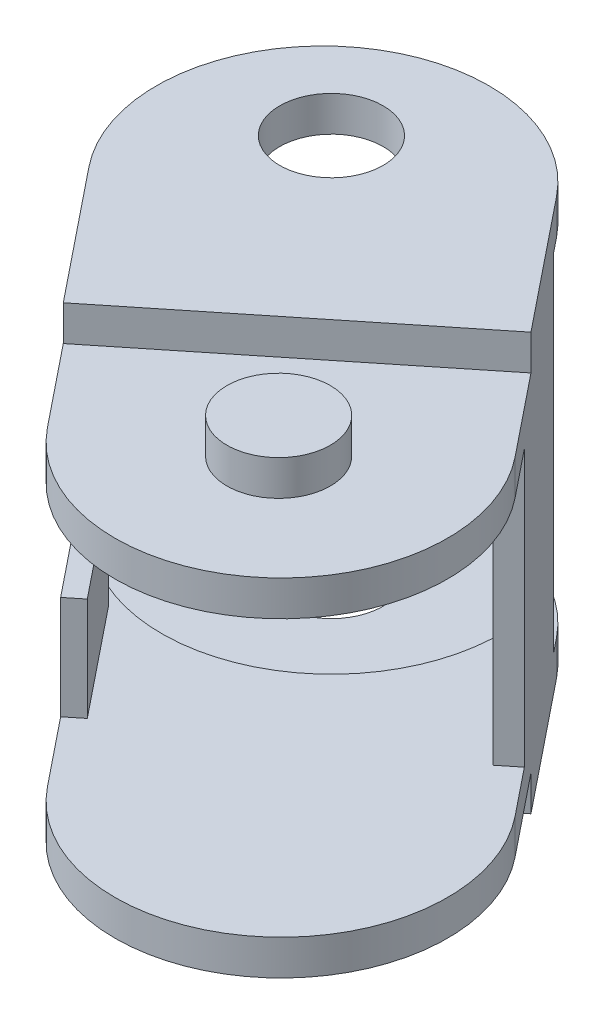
ISO-10303-21;
HEADER;
FILE_DESCRIPTION(('STEP AP214'),'2;1');
FILE_NAME('part.step','',(''),(''),'','','');
FILE_SCHEMA(('AUTOMOTIVE_DESIGN { 1 0 10303 214 1 1 1 1 }'));
ENDSEC;
DATA;
#1=APPLICATION_CONTEXT('core data for automotive mechanical design processes');
#2=APPLICATION_PROTOCOL_DEFINITION('international standard','automotive_design',2000,#1);
#3=PRODUCT_CONTEXT('',#1,'mechanical');
#4=PRODUCT('Part','Part','',(#3));
#5=PRODUCT_RELATED_PRODUCT_CATEGORY('part','',(#4));
#6=PRODUCT_DEFINITION_FORMATION('','',#4);
#7=PRODUCT_DEFINITION_CONTEXT('part definition',#1,'design');
#8=PRODUCT_DEFINITION('design','',#6,#7);
#9=PRODUCT_DEFINITION_SHAPE('','',#8);
#10=(LENGTH_UNIT() NAMED_UNIT(*) SI_UNIT(.MILLI.,.METRE.));
#11=(NAMED_UNIT(*) PLANE_ANGLE_UNIT() SI_UNIT($,.RADIAN.));
#12=(NAMED_UNIT(*) SI_UNIT($,.STERADIAN.) SOLID_ANGLE_UNIT());
#13=UNCERTAINTY_MEASURE_WITH_UNIT(LENGTH_MEASURE(1.E-05),#10,'distance_accuracy_value','');
#14=(GEOMETRIC_REPRESENTATION_CONTEXT(3) GLOBAL_UNCERTAINTY_ASSIGNED_CONTEXT((#13)) GLOBAL_UNIT_ASSIGNED_CONTEXT((#10,
#11,#12)) REPRESENTATION_CONTEXT('',''));
#15=CARTESIAN_POINT('',(0.,0.,0.));
#16=DIRECTION('',(0.,0.,1.));
#17=DIRECTION('',(1.,0.,0.));
#18=AXIS2_PLACEMENT_3D('',#15,#16,#17);
#19=CARTESIAN_POINT('',(-555.912651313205,6.,49.7104939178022));
#20=DIRECTION('',(0.,-1.,0.));
#21=DIRECTION('',(0.,0.,-1.));
#22=AXIS2_PLACEMENT_3D('',#19,#20,#21);
#23=PLANE('',#22);
#24=DIRECTION('',(0.626374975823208,0.,0.779521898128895));
#25=VECTOR('',#24,1.);
#26=CARTESIAN_POINT('',(-555.483914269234,6.,49.3659876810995));
#27=LINE('',#26,#25);
#28=CARTESIAN_POINT('',(-552.978414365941,6.,52.484075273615));
#29=VERTEX_POINT('',#28);
#30=CARTESIAN_POINT('',(-557.989414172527,6.,46.2479000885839));
#31=VERTEX_POINT('',#30);
#32=EDGE_CURVE('E313',#29,#31,#27,.F.);
#33=ORIENTED_EDGE('',*,*,#32,.T.);
#34=DIRECTION('',(0.779521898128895,0.,-0.626374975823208));
#35=VECTOR('',#34,1.);
#36=CARTESIAN_POINT('',(-558.418151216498,6.,46.5924063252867));
#37=LINE('',#36,#35);
#38=CARTESIAN_POINT('',(-558.846888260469,6.,46.9369125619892));
#39=VERTEX_POINT('',#38);
#40=EDGE_CURVE('E291',#31,#39,#37,.F.);
#41=ORIENTED_EDGE('',*,*,#40,.T.);
#42=DIRECTION('',(0.626374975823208,0.,0.779521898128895));
#43=VECTOR('',#42,1.);
#44=CARTESIAN_POINT('',(-555.621057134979,6.,50.9514503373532));
#45=LINE('',#44,#43);
#46=CARTESIAN_POINT('',(-553.835888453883,6.,53.1730877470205));
#47=VERTEX_POINT('',#46);
#48=EDGE_CURVE('E238',#47,#39,#45,.F.);
#49=ORIENTED_EDGE('',*,*,#48,.F.);
#50=DIRECTION('',(-0.779521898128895,0.,0.626374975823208));
#51=VECTOR('',#50,1.);
#52=CARTESIAN_POINT('',(-553.407151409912,6.,52.8285815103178));
#53=LINE('',#52,#51);
#54=EDGE_CURVE('E262',#47,#29,#53,.F.);
#55=ORIENTED_EDGE('',*,*,#54,.T.);
#56=EDGE_LOOP('',(#33,#41,#49,#55));
#57=FACE_BOUND('',#56,.T.);
#58=ADVANCED_FACE('F17',(#57),#23,.F.);
#59=CARTESIAN_POINT('',(-558.418151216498,8.,46.5924063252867));
#60=DIRECTION('',(0.626374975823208,0.,0.779521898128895));
#61=DIRECTION('',(0.779521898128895,0.,-0.626374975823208));
#62=AXIS2_PLACEMENT_3D('',#59,#60,#61);
#63=PLANE('',#62);
#64=DIRECTION('',(0.,1.,0.));
#65=VECTOR('',#64,1.);
#66=CARTESIAN_POINT('',(-557.989414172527,8.,46.2479000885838));
#67=LINE('',#66,#65);
#68=CARTESIAN_POINT('',(-557.989414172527,0.,46.2479000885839));
#69=VERTEX_POINT('',#68);
#70=EDGE_CURVE('E314',#31,#69,#67,.F.);
#71=ORIENTED_EDGE('',*,*,#70,.T.);
#72=DIRECTION('',(0.779521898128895,0.,-0.626374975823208));
#73=VECTOR('',#72,1.);
#74=CARTESIAN_POINT('',(-558.418151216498,0.,46.5924063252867));
#75=LINE('',#74,#73);
#76=CARTESIAN_POINT('',(-558.846888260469,0.,46.9369125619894));
#77=VERTEX_POINT('',#76);
#78=EDGE_CURVE('E301',#77,#69,#75,.T.);
#79=ORIENTED_EDGE('',*,*,#78,.F.);
#80=DIRECTION('',(0.,1.,0.));
#81=VECTOR('',#80,1.);
#82=CARTESIAN_POINT('',(-558.846888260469,20.1,46.9369125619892));
#83=LINE('',#82,#81);
#84=EDGE_CURVE('E282',#39,#77,#83,.F.);
#85=ORIENTED_EDGE('',*,*,#84,.F.);
#86=ORIENTED_EDGE('',*,*,#40,.F.);
#87=EDGE_LOOP('',(#71,#79,#85,#86));
#88=FACE_BOUND('',#87,.T.);
#89=ADVANCED_FACE('F925',(#88),#63,.F.);
#90=CARTESIAN_POINT('',(-552.264064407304,8.,39.7231111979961));
#91=DIRECTION('',(-0.626374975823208,0.,-0.779521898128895));
#92=DIRECTION('',(-0.779521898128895,0.,0.626374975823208));
#93=AXIS2_PLACEMENT_3D('',#90,#91,#92);
#94=PLANE('',#93);
#95=DIRECTION('',(0.,1.,0.));
#96=VECTOR('',#95,1.);
#97=CARTESIAN_POINT('',(-559.786450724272,20.1,45.7676297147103));
#98=LINE('',#97,#96);
#99=CARTESIAN_POINT('',(-559.78645072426,0.,45.7676297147));
#100=VERTEX_POINT('',#99);
#101=CARTESIAN_POINT('',(-559.786450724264,-2.05,45.7676297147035));
#102=VERTEX_POINT('',#101);
#103=EDGE_CURVE('E269',#100,#102,#98,.F.);
#104=ORIENTED_EDGE('',*,*,#103,.F.);
#105=DIRECTION('',(-0.779521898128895,0.,0.626374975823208));
#106=VECTOR('',#105,1.);
#107=CARTESIAN_POINT('',(-552.264064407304,0.,39.7231111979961));
#108=LINE('',#107,#106);
#109=CARTESIAN_POINT('',(-559.094228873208,0.,45.2114035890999));
#110=VERTEX_POINT('',#109);
#111=EDGE_CURVE('E274',#100,#110,#108,.F.);
#112=ORIENTED_EDGE('',*,*,#111,.T.);
#113=DIRECTION('',(0.,-1.,0.));
#114=VECTOR('',#113,1.);
#115=CARTESIAN_POINT('',(-559.094228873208,-1.025,45.2114035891));
#116=LINE('',#115,#114);
#117=CARTESIAN_POINT('',(-559.094228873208,-2.05,45.2114035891));
#118=VERTEX_POINT('',#117);
#119=EDGE_CURVE('E239',#110,#118,#116,.T.);
#120=ORIENTED_EDGE('',*,*,#119,.T.);
#121=DIRECTION('',(-0.77952189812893,0.,0.626374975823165));
#122=VECTOR('',#121,1.);
#123=CARTESIAN_POINT('',(-559.094228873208,-2.05,45.2114035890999));
#124=LINE('',#123,#122);
#125=EDGE_CURVE('E227',#118,#102,#124,.T.);
#126=ORIENTED_EDGE('',*,*,#125,.T.);
#127=EDGE_LOOP('',(#104,#112,#120,#126));
#128=FACE_BOUND('',#127,.T.);
#129=ADVANCED_FACE('F916',(#128),#94,.T.);
#130=CARTESIAN_POINT('',(-553.407151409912,8.,52.8285815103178));
#131=DIRECTION('',(-0.626374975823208,0.,-0.779521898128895));
#132=DIRECTION('',(-0.779521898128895,0.,0.626374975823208));
#133=AXIS2_PLACEMENT_3D('',#130,#131,#132);
#134=PLANE('',#133);
#135=DIRECTION('',(0.,1.,0.));
#136=VECTOR('',#135,1.);
#137=CARTESIAN_POINT('',(-553.835888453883,20.1,53.1730877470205));
#138=LINE('',#137,#136);
#139=CARTESIAN_POINT('',(-553.835888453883,0.,53.1730877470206));
#140=VERTEX_POINT('',#139);
#141=EDGE_CURVE('E268',#140,#47,#138,.T.);
#142=ORIENTED_EDGE('',*,*,#141,.F.);
#143=DIRECTION('',(-0.779521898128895,0.,0.626374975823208));
#144=VECTOR('',#143,1.);
#145=CARTESIAN_POINT('',(-553.407151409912,0.,52.8285815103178));
#146=LINE('',#145,#144);
#147=CARTESIAN_POINT('',(-552.978414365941,0.,52.4840752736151));
#148=VERTEX_POINT('',#147);
#149=EDGE_CURVE('E272',#148,#140,#146,.T.);
#150=ORIENTED_EDGE('',*,*,#149,.F.);
#151=DIRECTION('',(0.,1.,0.));
#152=VECTOR('',#151,1.);
#153=CARTESIAN_POINT('',(-552.978414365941,8.,52.4840752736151));
#154=LINE('',#153,#152);
#155=EDGE_CURVE('E310',#148,#29,#154,.T.);
#156=ORIENTED_EDGE('',*,*,#155,.T.);
#157=ORIENTED_EDGE('',*,*,#54,.F.);
#158=EDGE_LOOP('',(#142,#150,#156,#157));
#159=FACE_BOUND('',#158,.T.);
#160=ADVANCED_FACE('F907',(#159),#134,.F.);
#161=CARTESIAN_POINT('',(-542.555252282,-4.1,51.8057006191));
#162=DIRECTION('',(0.,-1.,0.));
#163=DIRECTION('',(0.,0.,-1.));
#164=AXIS2_PLACEMENT_3D('',#161,#162,#163);
#165=PLANE('',#164);
#166=CARTESIAN_POINT('',(-542.555252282,-4.1,51.8057006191));
#167=DIRECTION('',(0.,-1.,0.));
#168=DIRECTION('',(0.,0.,-1.));
#169=AXIS2_PLACEMENT_3D('',#166,#167,#168);
#170=CIRCLE('',#169,3.00000000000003);
#171=CARTESIAN_POINT('',(-542.555252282,-4.1,48.8057006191));
#172=VERTEX_POINT('',#171);
#173=EDGE_CURVE('E395',#172,#172,#170,.F.);
#174=ORIENTED_EDGE('',*,*,#173,.F.);
#175=EDGE_LOOP('',(#174));
#176=FACE_BOUND('',#175,.T.);
#177=ADVANCED_FACE('F898',(#176),#165,.T.);
#178=CARTESIAN_POINT('',(-542.555252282,20.1,51.8057006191));
#179=DIRECTION('',(0.,1.,0.));
#180=DIRECTION('',(0.,0.,1.));
#181=AXIS2_PLACEMENT_3D('',#178,#179,#180);
#182=PLANE('',#181);
#183=CARTESIAN_POINT('',(-542.555252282,20.1,51.8057006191));
#184=DIRECTION('',(0.,-1.,0.));
#185=DIRECTION('',(0.,0.,-1.));
#186=AXIS2_PLACEMENT_3D('',#183,#184,#185);
#187=CIRCLE('',#186,3.00000000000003);
#188=CARTESIAN_POINT('',(-542.555252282,20.1,48.8057006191));
#189=VERTEX_POINT('',#188);
#190=EDGE_CURVE('E391',#189,#189,#187,.T.);
#191=ORIENTED_EDGE('',*,*,#190,.F.);
#192=EDGE_LOOP('',(#191));
#193=FACE_BOUND('',#192,.T.);
#194=ADVANCED_FACE('F889',(#193),#182,.T.);
#195=CARTESIAN_POINT('',(-555.082751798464,-3.075,36.2152626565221));
#196=DIRECTION('',(0.,-1.,0.));
#197=DIRECTION('',(0.,0.,-1.));
#198=AXIS2_PLACEMENT_3D('',#195,#196,#197);
#199=CYLINDRICAL_SURFACE('',#198,3.00000000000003);
#200=CARTESIAN_POINT('',(-555.082751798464,-4.1,36.2152626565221));
#201=DIRECTION('',(0.,-1.,0.));
#202=DIRECTION('',(0.,0.,-1.));
#203=AXIS2_PLACEMENT_3D('',#200,#201,#202);
#204=CIRCLE('',#203,3.00000000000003);
#205=CARTESIAN_POINT('',(-555.082751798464,-4.1,33.2152626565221));
#206=VERTEX_POINT('',#205);
#207=EDGE_CURVE('E381',#206,#206,#204,.F.);
#208=ORIENTED_EDGE('',*,*,#207,.F.);
#209=EDGE_LOOP('',(#208));
#210=FACE_BOUND('',#209,.T.);
#211=CARTESIAN_POINT('',(-555.082751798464,-2.05,36.2152626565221));
#212=DIRECTION('',(0.,-1.,0.));
#213=DIRECTION('',(0.,0.,-1.));
#214=AXIS2_PLACEMENT_3D('',#211,#212,#213);
#215=CIRCLE('',#214,3.00000000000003);
#216=CARTESIAN_POINT('',(-555.082751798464,-2.05,33.2152626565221));
#217=VERTEX_POINT('',#216);
#218=EDGE_CURVE('E20',#217,#217,#215,.F.);
#219=ORIENTED_EDGE('',*,*,#218,.T.);
#220=EDGE_LOOP('',(#219));
#221=FACE_BOUND('',#220,.T.);
#222=ADVANCED_FACE('F880',(#210,#221),#199,.F.);
#223=CARTESIAN_POINT('',(-558.527814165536,-2.05,31.9278922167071));
#224=DIRECTION('',(0.,-1.,0.));
#225=DIRECTION('',(0.,0.,-1.));
#226=AXIS2_PLACEMENT_3D('',#223,#224,#225);
#227=PLANE('',#226);
#228=ORIENTED_EDGE('',*,*,#218,.F.);
#229=EDGE_LOOP('',(#228));
#230=FACE_BOUND('',#229,.T.);
#231=DIRECTION('',(0.626374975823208,0.,0.779521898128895));
#232=VECTOR('',#231,1.);
#233=CARTESIAN_POINT('',(-555.621057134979,-2.05,50.9514503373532));
#234=LINE('',#233,#232);
#235=CARTESIAN_POINT('',(-560.538100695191,-2.05,44.8322034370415));
#236=VERTEX_POINT('',#235);
#237=EDGE_CURVE('E265',#102,#236,#234,.F.);
#238=ORIENTED_EDGE('',*,*,#237,.F.);
#239=ORIENTED_EDGE('',*,*,#125,.F.);
#240=CARTESIAN_POINT('',(-555.082751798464,-2.05,36.2152626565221));
#241=DIRECTION('',(0.,-1.,0.));
#242=DIRECTION('',(0.,0.,-1.));
#243=AXIS2_PLACEMENT_3D('',#240,#241,#242);
#244=CIRCLE('',#243,9.85000000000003);
#245=CARTESIAN_POINT('',(-545.433899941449,-2.05,34.2348188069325));
#246=VERTEX_POINT('',#245);
#247=EDGE_CURVE('E232',#118,#246,#244,.F.);
#248=ORIENTED_EDGE('',*,*,#247,.T.);
#249=DIRECTION('',(-0.779521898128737,0.,0.626374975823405));
#250=VECTOR('',#249,1.);
#251=CARTESIAN_POINT('',(-544.74167809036,-2.05,33.6785926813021));
#252=LINE('',#251,#250);
#253=CARTESIAN_POINT('',(-544.741678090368,-2.05,33.6785926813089));
#254=VERTEX_POINT('',#253);
#255=EDGE_CURVE('E217',#254,#246,#252,.T.);
#256=ORIENTED_EDGE('',*,*,#255,.F.);
#257=DIRECTION('',(0.626374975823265,0.,0.779521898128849));
#258=VECTOR('',#257,1.);
#259=CARTESIAN_POINT('',(-545.493328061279,-2.05,32.7431664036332));
#260=LINE('',#259,#258);
#261=CARTESIAN_POINT('',(-545.493328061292,-2.05,32.7431664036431));
#262=VERTEX_POINT('',#261);
#263=EDGE_CURVE('E228',#262,#254,#260,.T.);
#264=ORIENTED_EDGE('',*,*,#263,.F.);
#265=CARTESIAN_POINT('',(-553.015714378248,-2.05,38.7876849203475));
#266=DIRECTION('',(0.,-1.,0.));
#267=DIRECTION('',(0.,0.,-1.));
#268=AXIS2_PLACEMENT_3D('',#265,#266,#267);
#269=CIRCLE('',#268,9.64999999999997);
#270=EDGE_CURVE('E378',#236,#262,#269,.T.);
#271=ORIENTED_EDGE('',*,*,#270,.F.);
#272=EDGE_LOOP('',(#238,#239,#248,#256,#264,#271));
#273=FACE_BOUND('',#272,.T.);
#274=ADVANCED_FACE('F234',(#230,#273),#227,.F.);
#275=CARTESIAN_POINT('',(-555.483914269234,8.,49.3659876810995));
#276=DIRECTION('',(-0.779521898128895,0.,0.626374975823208));
#277=DIRECTION('',(0.626374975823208,0.,0.779521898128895));
#278=AXIS2_PLACEMENT_3D('',#275,#276,#277);
#279=PLANE('',#278);
#280=ORIENTED_EDGE('',*,*,#155,.F.);
#281=DIRECTION('',(-0.626374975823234,0.,-0.779521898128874));
#282=VECTOR('',#281,1.);
#283=CARTESIAN_POINT('',(-552.978414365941,0.,52.4840752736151));
#284=LINE('',#283,#282);
#285=EDGE_CURVE('E298',#148,#69,#284,.T.);
#286=ORIENTED_EDGE('',*,*,#285,.T.);
#287=ORIENTED_EDGE('',*,*,#70,.F.);
#288=ORIENTED_EDGE('',*,*,#32,.F.);
#289=EDGE_LOOP('',(#280,#286,#287,#288));
#290=FACE_BOUND('',#289,.T.);
#291=ADVANCED_FACE('F864',(#290),#279,.F.);
#292=CARTESIAN_POINT('',(-555.082751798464,-1.025,36.2152626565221));
#293=DIRECTION('',(0.,-1.,0.));
#294=DIRECTION('',(0.,0.,-1.));
#295=AXIS2_PLACEMENT_3D('',#292,#293,#294);
#296=CYLINDRICAL_SURFACE('',#295,9.85000000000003);
#297=CARTESIAN_POINT('',(-555.082751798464,0.,36.2152626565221));
#298=DIRECTION('',(0.,-1.,0.));
#299=DIRECTION('',(0.,0.,-1.));
#300=AXIS2_PLACEMENT_3D('',#297,#298,#299);
#301=CIRCLE('',#300,9.85000000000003);
#302=CARTESIAN_POINT('',(-545.303073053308,0.,35.0403653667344));
#303=VERTEX_POINT('',#302);
#304=EDGE_CURVE('E297',#110,#303,#301,.F.);
#305=ORIENTED_EDGE('',*,*,#304,.T.);
#306=CARTESIAN_POINT('',(-555.082751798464,0.,36.2152626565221));
#307=DIRECTION('',(0.,-1.,0.));
#308=DIRECTION('',(0.,0.,-1.));
#309=AXIS2_PLACEMENT_3D('',#306,#307,#308);
#310=CIRCLE('',#309,9.85000000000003);
#311=CARTESIAN_POINT('',(-545.433899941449,0.,34.2348188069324));
#312=VERTEX_POINT('',#311);
#313=EDGE_CURVE('E242',#303,#312,#310,.F.);
#314=ORIENTED_EDGE('',*,*,#313,.T.);
#315=DIRECTION('',(0.,1.,0.));
#316=VECTOR('',#315,1.);
#317=CARTESIAN_POINT('',(-545.433899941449,8.,34.2348188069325));
#318=LINE('',#317,#316);
#319=EDGE_CURVE('E222',#246,#312,#318,.T.);
#320=ORIENTED_EDGE('',*,*,#319,.F.);
#321=ORIENTED_EDGE('',*,*,#247,.F.);
#322=ORIENTED_EDGE('',*,*,#119,.F.);
#323=EDGE_LOOP('',(#305,#314,#320,#321,#322));
#324=FACE_BOUND('',#323,.T.);
#325=ADVANCED_FACE('F240',(#324),#296,.F.);
#326=CARTESIAN_POINT('',(-555.621057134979,20.1,50.9514503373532));
#327=DIRECTION('',(-0.779521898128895,0.,0.626374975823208));
#328=DIRECTION('',(0.626374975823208,0.,0.779521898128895));
#329=AXIS2_PLACEMENT_3D('',#326,#327,#328);
#330=PLANE('',#329);
#331=DIRECTION('',(-0.626374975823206,0.,-0.779521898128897));
#332=VECTOR('',#331,1.);
#333=CARTESIAN_POINT('',(-550.704013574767,0.,57.0706972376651));
#334=LINE('',#333,#332);
#335=CARTESIAN_POINT('',(-550.704013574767,0.,57.0706972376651));
#336=VERTEX_POINT('',#335);
#337=EDGE_CURVE('E323',#336,#140,#334,.T.);
#338=ORIENTED_EDGE('',*,*,#337,.T.);
#339=ORIENTED_EDGE('',*,*,#141,.T.);
#340=ORIENTED_EDGE('',*,*,#48,.T.);
#341=ORIENTED_EDGE('',*,*,#84,.T.);
#342=DIRECTION('',(-0.626374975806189,0.,-0.77952189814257));
#343=VECTOR('',#342,1.);
#344=CARTESIAN_POINT('',(-558.846888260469,0.,46.9369125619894));
#345=LINE('',#344,#343);
#346=EDGE_CURVE('E294',#77,#100,#345,.T.);
#347=ORIENTED_EDGE('',*,*,#346,.T.);
#348=ORIENTED_EDGE('',*,*,#103,.T.);
#349=ORIENTED_EDGE('',*,*,#237,.T.);
#350=DIRECTION('',(0.,-1.,0.));
#351=VECTOR('',#350,1.);
#352=CARTESIAN_POINT('',(-560.538100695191,20.1,44.8322034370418));
#353=LINE('',#352,#351);
#354=CARTESIAN_POINT('',(-560.538100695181,-4.1,44.8322034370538));
#355=VERTEX_POINT('',#354);
#356=EDGE_CURVE('E245',#355,#236,#353,.F.);
#357=ORIENTED_EDGE('',*,*,#356,.F.);
#358=DIRECTION('',(-0.626374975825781,0.,-0.779521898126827));
#359=VECTOR('',#358,1.);
#360=CARTESIAN_POINT('',(-554.46226342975,-4.1,52.3935658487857));
#361=LINE('',#360,#359);
#362=CARTESIAN_POINT('',(-554.46226342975,-4.1,52.3935658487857));
#363=VERTEX_POINT('',#362);
#364=EDGE_CURVE('E384',#363,#355,#361,.T.);
#365=ORIENTED_EDGE('',*,*,#364,.F.);
#366=DIRECTION('',(0.,1.,0.));
#367=VECTOR('',#366,1.);
#368=CARTESIAN_POINT('',(-554.46226342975,-3.075,52.3935658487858));
#369=LINE('',#368,#367);
#370=CARTESIAN_POINT('',(-554.46226342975,-2.05,52.3935658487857));
#371=VERTEX_POINT('',#370);
#372=EDGE_CURVE('E386',#371,#363,#369,.F.);
#373=ORIENTED_EDGE('',*,*,#372,.F.);
#374=DIRECTION('',(-0.626374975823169,0.,-0.779521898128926));
#375=VECTOR('',#374,1.);
#376=CARTESIAN_POINT('',(-550.704013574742,-2.05,57.0706972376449));
#377=LINE('',#376,#375);
#378=CARTESIAN_POINT('',(-550.704013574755,-2.05,57.0706972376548));
#379=VERTEX_POINT('',#378);
#380=EDGE_CURVE('E370',#379,#371,#377,.T.);
#381=ORIENTED_EDGE('',*,*,#380,.F.);
#382=DIRECTION('',(0.,-1.,0.));
#383=VECTOR('',#382,1.);
#384=CARTESIAN_POINT('',(-550.704013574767,20.1,57.0706972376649));
#385=LINE('',#384,#383);
#386=EDGE_CURVE('E371',#336,#379,#385,.T.);
#387=ORIENTED_EDGE('',*,*,#386,.F.);
#388=EDGE_LOOP('',(#338,#339,#340,#341,#347,#348,#349,#357,#365,#373,#381,#387));
#389=FACE_BOUND('',#388,.T.);
#390=ADVANCED_FACE('F510',(#389),#330,.T.);
#391=CARTESIAN_POINT('',(-542.555252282,-3.075,51.8057006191));
#392=DIRECTION('',(0.,-1.,0.));
#393=DIRECTION('',(0.,0.,-1.));
#394=AXIS2_PLACEMENT_3D('',#391,#392,#393);
#395=CYLINDRICAL_SURFACE('',#394,3.00000000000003);
#396=CARTESIAN_POINT('',(-542.555252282,-2.05,51.8057006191));
#397=DIRECTION('',(0.,-1.,0.));
#398=DIRECTION('',(0.,0.,-1.));
#399=AXIS2_PLACEMENT_3D('',#396,#397,#398);
#400=CIRCLE('',#399,3.00000000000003);
#401=CARTESIAN_POINT('',(-542.555252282,-2.05,48.8057006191));
#402=VERTEX_POINT('',#401);
#403=EDGE_CURVE('E363',#402,#402,#400,.F.);
#404=ORIENTED_EDGE('',*,*,#403,.F.);
#405=EDGE_LOOP('',(#404));
#406=FACE_BOUND('',#405,.T.);
#407=ORIENTED_EDGE('',*,*,#173,.T.);
#408=EDGE_LOOP('',(#407));
#409=FACE_BOUND('',#408,.T.);
#410=ADVANCED_FACE('F840',(#406,#409),#395,.T.);
#411=CARTESIAN_POINT('',(-542.555252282,19.075,51.8057006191));
#412=DIRECTION('',(0.,-1.,0.));
#413=DIRECTION('',(0.,0.,-1.));
#414=AXIS2_PLACEMENT_3D('',#411,#412,#413);
#415=CYLINDRICAL_SURFACE('',#414,3.00000000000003);
#416=ORIENTED_EDGE('',*,*,#190,.T.);
#417=EDGE_LOOP('',(#416));
#418=FACE_BOUND('',#417,.T.);
#419=CARTESIAN_POINT('',(-542.555252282,18.05,51.8057006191));
#420=DIRECTION('',(0.,-1.,0.));
#421=DIRECTION('',(0.,0.,-1.));
#422=AXIS2_PLACEMENT_3D('',#419,#420,#421);
#423=CIRCLE('',#422,3.00000000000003);
#424=CARTESIAN_POINT('',(-542.555252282,18.05,48.8057006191));
#425=VERTEX_POINT('',#424);
#426=EDGE_CURVE('E359',#425,#425,#423,.F.);
#427=ORIENTED_EDGE('',*,*,#426,.T.);
#428=EDGE_LOOP('',(#427));
#429=FACE_BOUND('',#428,.T.);
#430=ADVANCED_FACE('F831',(#418,#429),#415,.T.);
#431=CARTESIAN_POINT('',(-555.082751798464,19.075,36.2152626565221));
#432=DIRECTION('',(0.,-1.,0.));
#433=DIRECTION('',(0.,0.,-1.));
#434=AXIS2_PLACEMENT_3D('',#431,#432,#433);
#435=CYLINDRICAL_SURFACE('',#434,3.00000000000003);
#436=CARTESIAN_POINT('',(-555.082751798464,18.05,36.2152626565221));
#437=DIRECTION('',(0.,-1.,0.));
#438=DIRECTION('',(0.,0.,-1.));
#439=AXIS2_PLACEMENT_3D('',#436,#437,#438);
#440=CIRCLE('',#439,3.00000000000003);
#441=CARTESIAN_POINT('',(-555.082751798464,18.05,33.2152626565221));
#442=VERTEX_POINT('',#441);
#443=EDGE_CURVE('E387',#442,#442,#440,.F.);
#444=ORIENTED_EDGE('',*,*,#443,.F.);
#445=EDGE_LOOP('',(#444));
#446=FACE_BOUND('',#445,.T.);
#447=CARTESIAN_POINT('',(-555.082751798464,20.1,36.2152626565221));
#448=DIRECTION('',(0.,-1.,0.));
#449=DIRECTION('',(0.,0.,-1.));
#450=AXIS2_PLACEMENT_3D('',#447,#448,#449);
#451=CIRCLE('',#450,3.00000000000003);
#452=CARTESIAN_POINT('',(-555.082751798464,20.1,33.2152626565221));
#453=VERTEX_POINT('',#452);
#454=EDGE_CURVE('E355',#453,#453,#451,.F.);
#455=ORIENTED_EDGE('',*,*,#454,.T.);
#456=EDGE_LOOP('',(#455));
#457=FACE_BOUND('',#456,.T.);
#458=ADVANCED_FACE('F822',(#446,#457),#435,.F.);
#459=CARTESIAN_POINT('',(-558.527814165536,18.05,31.9278922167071));
#460=DIRECTION('',(0.,-1.,0.));
#461=DIRECTION('',(0.,0.,-1.));
#462=AXIS2_PLACEMENT_3D('',#459,#460,#461);
#463=PLANE('',#462);
#464=ORIENTED_EDGE('',*,*,#443,.T.);
#465=EDGE_LOOP('',(#464));
#466=FACE_BOUND('',#465,.T.);
#467=DIRECTION('',(-0.779521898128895,0.,0.626374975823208));
#468=VECTOR('',#467,1.);
#469=CARTESIAN_POINT('',(-552.264064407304,18.05,39.7231111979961));
#470=LINE('',#469,#468);
#471=CARTESIAN_POINT('',(-559.78645072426,18.05,45.7676297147));
#472=VERTEX_POINT('',#471);
#473=CARTESIAN_POINT('',(-559.094228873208,18.05,45.2114035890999));
#474=VERTEX_POINT('',#473);
#475=EDGE_CURVE('E466',#472,#474,#470,.F.);
#476=ORIENTED_EDGE('',*,*,#475,.F.);
#477=DIRECTION('',(-0.626374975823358,0.,-0.779521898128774));
#478=VECTOR('',#477,1.);
#479=CARTESIAN_POINT('',(-559.786450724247,18.05,45.76762971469));
#480=LINE('',#479,#478);
#481=CARTESIAN_POINT('',(-560.538100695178,18.05,44.8322034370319));
#482=VERTEX_POINT('',#481);
#483=EDGE_CURVE('E390',#472,#482,#480,.T.);
#484=ORIENTED_EDGE('',*,*,#483,.T.);
#485=CARTESIAN_POINT('',(-553.015714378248,18.05,38.7876849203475));
#486=DIRECTION('',(0.,-1.,0.));
#487=DIRECTION('',(0.,0.,-1.));
#488=AXIS2_PLACEMENT_3D('',#485,#486,#487);
#489=CIRCLE('',#488,9.64999999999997);
#490=CARTESIAN_POINT('',(-545.493328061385,18.05,32.7431664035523));
#491=VERTEX_POINT('',#490);
#492=EDGE_CURVE('E352',#491,#482,#489,.F.);
#493=ORIENTED_EDGE('',*,*,#492,.F.);
#494=DIRECTION('',(0.626374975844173,0.,0.779521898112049));
#495=VECTOR('',#494,1.);
#496=CARTESIAN_POINT('',(-545.493328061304,18.05,32.7431664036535));
#497=LINE('',#496,#495);
#498=CARTESIAN_POINT('',(-544.741678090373,18.05,33.6785926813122));
#499=VERTEX_POINT('',#498);
#500=EDGE_CURVE('E394',#491,#499,#497,.T.);
#501=ORIENTED_EDGE('',*,*,#500,.T.);
#502=DIRECTION('',(-0.779521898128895,0.,0.626374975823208));
#503=VECTOR('',#502,1.);
#504=CARTESIAN_POINT('',(-552.264064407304,18.05,39.7231111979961));
#505=LINE('',#504,#503);
#506=CARTESIAN_POINT('',(-545.433899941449,18.05,34.2348188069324));
#507=VERTEX_POINT('',#506);
#508=EDGE_CURVE('E445',#507,#499,#505,.F.);
#509=ORIENTED_EDGE('',*,*,#508,.F.);
#510=CARTESIAN_POINT('',(-555.082751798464,18.05,36.2152626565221));
#511=DIRECTION('',(0.,-1.,0.));
#512=DIRECTION('',(0.,0.,-1.));
#513=AXIS2_PLACEMENT_3D('',#510,#511,#512);
#514=CIRCLE('',#513,9.85000000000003);
#515=EDGE_CURVE('E342',#507,#474,#514,.T.);
#516=ORIENTED_EDGE('',*,*,#515,.T.);
#517=EDGE_LOOP('',(#476,#484,#493,#501,#509,#516));
#518=FACE_BOUND('',#517,.T.);
#519=ADVANCED_FACE('F813',(#466,#518),#463,.T.);
#520=CARTESIAN_POINT('',(-555.082751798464,0.,36.2152626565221));
#521=DIRECTION('',(0.,1.,0.));
#522=DIRECTION('',(0.,0.,1.));
#523=AXIS2_PLACEMENT_3D('',#520,#521,#522);
#524=PLANE('',#523);
#525=ORIENTED_EDGE('',*,*,#313,.F.);
#526=DIRECTION('',(-0.626374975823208,0.,-0.779521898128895));
#527=VECTOR('',#526,1.);
#528=CARTESIAN_POINT('',(-542.302666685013,0.,38.7743626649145));
#529=LINE('',#528,#527);
#530=CARTESIAN_POINT('',(-545.747729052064,0.,34.4869922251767));
#531=VERTEX_POINT('',#530);
#532=EDGE_CURVE('E434',#303,#531,#529,.T.);
#533=ORIENTED_EDGE('',*,*,#532,.T.);
#534=DIRECTION('',(-0.779521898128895,0.,0.626374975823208));
#535=VECTOR('',#534,1.);
#536=CARTESIAN_POINT('',(-552.264064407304,0.,39.7231111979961));
#537=LINE('',#536,#535);
#538=EDGE_CURVE('E244',#312,#531,#537,.T.);
#539=ORIENTED_EDGE('',*,*,#538,.F.);
#540=EDGE_LOOP('',(#525,#533,#539));
#541=FACE_BOUND('',#540,.T.);
#542=ADVANCED_FACE('F581',(#541),#524,.F.);
#543=CARTESIAN_POINT('',(-555.082751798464,16.,36.2152626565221));
#544=DIRECTION('',(0.,-1.,0.));
#545=DIRECTION('',(0.,0.,-1.));
#546=AXIS2_PLACEMENT_3D('',#543,#544,#545);
#547=PLANE('',#546);
#548=CARTESIAN_POINT('',(-555.082751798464,16.,36.2152626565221));
#549=DIRECTION('',(0.,-1.,0.));
#550=DIRECTION('',(0.,0.,-1.));
#551=AXIS2_PLACEMENT_3D('',#548,#549,#550);
#552=CIRCLE('',#551,9.85000000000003);
#553=CARTESIAN_POINT('',(-545.303073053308,16.,35.0403653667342));
#554=VERTEX_POINT('',#553);
#555=CARTESIAN_POINT('',(-545.433899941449,16.,34.2348188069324));
#556=VERTEX_POINT('',#555);
#557=EDGE_CURVE('E346',#554,#556,#552,.F.);
#558=ORIENTED_EDGE('',*,*,#557,.T.);
#559=DIRECTION('',(-0.779521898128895,0.,0.626374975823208));
#560=VECTOR('',#559,1.);
#561=CARTESIAN_POINT('',(-552.264064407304,16.,39.7231111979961));
#562=LINE('',#561,#560);
#563=CARTESIAN_POINT('',(-545.747729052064,16.,34.4869922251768));
#564=VERTEX_POINT('',#563);
#565=EDGE_CURVE('E247',#564,#556,#562,.F.);
#566=ORIENTED_EDGE('',*,*,#565,.F.);
#567=DIRECTION('',(-0.626374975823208,0.,-0.779521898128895));
#568=VECTOR('',#567,1.);
#569=CARTESIAN_POINT('',(-542.302666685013,16.,38.7743626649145));
#570=LINE('',#569,#568);
#571=EDGE_CURVE('E440',#564,#554,#570,.F.);
#572=ORIENTED_EDGE('',*,*,#571,.T.);
#573=EDGE_LOOP('',(#558,#566,#572));
#574=FACE_BOUND('',#573,.T.);
#575=ADVANCED_FACE('F572',(#574),#547,.F.);
#576=CARTESIAN_POINT('',(-546.939877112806,-3.075,46.3490473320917));
#577=DIRECTION('',(0.626374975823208,0.,0.779521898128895));
#578=DIRECTION('',(0.779521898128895,0.,-0.626374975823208));
#579=AXIS2_PLACEMENT_3D('',#576,#577,#578);
#580=PLANE('',#579);
#581=DIRECTION('',(0.,1.,0.));
#582=VECTOR('',#581,1.);
#583=CARTESIAN_POINT('',(-539.417490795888,20.1,40.3045288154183));
#584=LINE('',#583,#582);
#585=CARTESIAN_POINT('',(-539.417490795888,-2.05,40.3045288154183));
#586=VERTEX_POINT('',#585);
#587=CARTESIAN_POINT('',(-539.417490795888,-4.1,40.3045288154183));
#588=VERTEX_POINT('',#587);
#589=EDGE_CURVE('E419',#586,#588,#584,.F.);
#590=ORIENTED_EDGE('',*,*,#589,.F.);
#591=DIRECTION('',(0.779521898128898,0.,-0.626374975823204));
#592=VECTOR('',#591,1.);
#593=CARTESIAN_POINT('',(-554.46226342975,-2.05,52.3935658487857));
#594=LINE('',#593,#592);
#595=EDGE_CURVE('E366',#371,#586,#594,.T.);
#596=ORIENTED_EDGE('',*,*,#595,.F.);
#597=ORIENTED_EDGE('',*,*,#372,.T.);
#598=DIRECTION('',(-0.779521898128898,0.,0.626374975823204));
#599=VECTOR('',#598,1.);
#600=CARTESIAN_POINT('',(-539.417490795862,-4.1,40.3045288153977));
#601=LINE('',#600,#599);
#602=EDGE_CURVE('E427',#588,#363,#601,.T.);
#603=ORIENTED_EDGE('',*,*,#602,.F.);
#604=EDGE_LOOP('',(#590,#596,#597,#603));
#605=FACE_BOUND('',#604,.T.);
#606=ADVANCED_FACE('F570',(#605),#580,.T.);
#607=CARTESIAN_POINT('',(-548.098670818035,-4.1,44.9069318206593));
#608=DIRECTION('',(0.,-1.,0.));
#609=DIRECTION('',(0.,0.,-1.));
#610=AXIS2_PLACEMENT_3D('',#607,#608,#609);
#611=PLANE('',#610);
#612=ORIENTED_EDGE('',*,*,#207,.T.);
#613=EDGE_LOOP('',(#612));
#614=FACE_BOUND('',#613,.T.);
#615=CARTESIAN_POINT('',(-553.015714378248,-4.1,38.7876849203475));
#616=DIRECTION('',(0.,-1.,0.));
#617=DIRECTION('',(0.,0.,-1.));
#618=AXIS2_PLACEMENT_3D('',#615,#616,#617);
#619=CIRCLE('',#618,9.64999999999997);
#620=CARTESIAN_POINT('',(-545.493328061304,-4.1,32.7431664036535));
#621=VERTEX_POINT('',#620);
#622=EDGE_CURVE('E250',#621,#355,#619,.F.);
#623=ORIENTED_EDGE('',*,*,#622,.F.);
#624=DIRECTION('',(-0.626374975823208,0.,-0.779521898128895));
#625=VECTOR('',#624,1.);
#626=CARTESIAN_POINT('',(-540.576284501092,-4.1,38.8624133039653));
#627=LINE('',#626,#625);
#628=EDGE_CURVE('E415',#588,#621,#627,.T.);
#629=ORIENTED_EDGE('',*,*,#628,.F.);
#630=ORIENTED_EDGE('',*,*,#602,.T.);
#631=ORIENTED_EDGE('',*,*,#364,.T.);
#632=EDGE_LOOP('',(#623,#629,#630,#631));
#633=FACE_BOUND('',#632,.T.);
#634=ADVANCED_FACE('F565',(#614,#633),#611,.T.);
#635=CARTESIAN_POINT('',(-553.015714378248,20.1,38.7876849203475));
#636=DIRECTION('',(0.,-1.,0.));
#637=DIRECTION('',(0.,0.,-1.));
#638=AXIS2_PLACEMENT_3D('',#635,#636,#637);
#639=CYLINDRICAL_SURFACE('',#638,9.64999999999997);
#640=ORIENTED_EDGE('',*,*,#622,.T.);
#641=ORIENTED_EDGE('',*,*,#356,.T.);
#642=ORIENTED_EDGE('',*,*,#270,.T.);
#643=DIRECTION('',(0.,1.,0.));
#644=VECTOR('',#643,1.);
#645=CARTESIAN_POINT('',(-545.493328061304,20.1,32.7431664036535));
#646=LINE('',#645,#644);
#647=EDGE_CURVE('E409',#621,#262,#646,.T.);
#648=ORIENTED_EDGE('',*,*,#647,.F.);
#649=EDGE_LOOP('',(#640,#641,#642,#648));
#650=FACE_BOUND('',#649,.T.);
#651=ADVANCED_FACE('F568',(#650),#639,.T.);
#652=CARTESIAN_POINT('',(-552.264064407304,8.,39.7231111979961));
#653=DIRECTION('',(-0.626374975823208,0.,-0.779521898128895));
#654=DIRECTION('',(-0.779521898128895,0.,0.626374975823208));
#655=AXIS2_PLACEMENT_3D('',#652,#653,#654);
#656=PLANE('',#655);
#657=DIRECTION('',(0.,1.,0.));
#658=VECTOR('',#657,1.);
#659=CARTESIAN_POINT('',(-544.741678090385,20.1,33.6785926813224));
#660=LINE('',#659,#658);
#661=EDGE_CURVE('E225',#254,#499,#660,.T.);
#662=ORIENTED_EDGE('',*,*,#661,.F.);
#663=ORIENTED_EDGE('',*,*,#255,.T.);
#664=ORIENTED_EDGE('',*,*,#319,.T.);
#665=ORIENTED_EDGE('',*,*,#538,.T.);
#666=DIRECTION('',(0.,1.,0.));
#667=VECTOR('',#666,1.);
#668=CARTESIAN_POINT('',(-545.747729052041,8.,34.4869922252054));
#669=LINE('',#668,#667);
#670=EDGE_CURVE('E437',#531,#564,#669,.T.);
#671=ORIENTED_EDGE('',*,*,#670,.T.);
#672=ORIENTED_EDGE('',*,*,#565,.T.);
#673=DIRECTION('',(0.,-1.,0.));
#674=VECTOR('',#673,1.);
#675=CARTESIAN_POINT('',(-545.433899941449,17.025,34.2348188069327));
#676=LINE('',#675,#674);
#677=EDGE_CURVE('E345',#556,#507,#676,.F.);
#678=ORIENTED_EDGE('',*,*,#677,.T.);
#679=ORIENTED_EDGE('',*,*,#508,.T.);
#680=EDGE_LOOP('',(#662,#663,#664,#665,#671,#672,#678,#679));
#681=FACE_BOUND('',#680,.T.);
#682=ADVANCED_FACE('F219',(#681),#656,.T.);
#683=CARTESIAN_POINT('',(-538.354578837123,8.,42.6575333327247));
#684=DIRECTION('',(-0.626374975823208,0.,-0.779521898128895));
#685=DIRECTION('',(-0.779521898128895,0.,0.626374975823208));
#686=AXIS2_PLACEMENT_3D('',#683,#684,#685);
#687=PLANE('',#686);
#688=DIRECTION('',(-0.779521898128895,0.,0.626374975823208));
#689=VECTOR('',#688,1.);
#690=CARTESIAN_POINT('',(-538.354578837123,16.,42.6575333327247));
#691=LINE('',#690,#689);
#692=CARTESIAN_POINT('',(-538.857604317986,16.,43.0617331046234));
#693=VERTEX_POINT('',#692);
#694=CARTESIAN_POINT('',(-537.851553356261,16.,42.2533335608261));
#695=VERTEX_POINT('',#694);
#696=EDGE_CURVE('E462',#693,#695,#691,.F.);
#697=ORIENTED_EDGE('',*,*,#696,.F.);
#698=DIRECTION('',(0.,1.,0.));
#699=VECTOR('',#698,1.);
#700=CARTESIAN_POINT('',(-538.857604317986,8.,43.0617331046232));
#701=LINE('',#700,#699);
#702=CARTESIAN_POINT('',(-538.857604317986,0.,43.0617331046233));
#703=VERTEX_POINT('',#702);
#704=EDGE_CURVE('E539',#693,#703,#701,.F.);
#705=ORIENTED_EDGE('',*,*,#704,.T.);
#706=DIRECTION('',(0.779521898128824,0.,-0.626374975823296));
#707=VECTOR('',#706,1.);
#708=CARTESIAN_POINT('',(-538.857604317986,0.,43.0617331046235));
#709=LINE('',#708,#707);
#710=CARTESIAN_POINT('',(-537.851553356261,0.,42.253333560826));
#711=VERTEX_POINT('',#710);
#712=EDGE_CURVE('E545',#703,#711,#709,.T.);
#713=ORIENTED_EDGE('',*,*,#712,.T.);
#714=DIRECTION('',(0.,1.,0.));
#715=VECTOR('',#714,1.);
#716=CARTESIAN_POINT('',(-537.851553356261,20.1,42.253333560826));
#717=LINE('',#716,#715);
#718=EDGE_CURVE('E528',#695,#711,#717,.F.);
#719=ORIENTED_EDGE('',*,*,#718,.F.);
#720=EDGE_LOOP('',(#697,#705,#713,#719));
#721=FACE_BOUND('',#720,.T.);
#722=ADVANCED_FACE('F653',(#721),#687,.F.);
#723=CARTESIAN_POINT('',(-548.819002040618,0.,44.0104816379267));
#724=DIRECTION('',(0.,-1.,0.));
#725=DIRECTION('',(0.,0.,-1.));
#726=AXIS2_PLACEMENT_3D('',#723,#724,#725);
#727=PLANE('',#726);
#728=ORIENTED_EDGE('',*,*,#304,.F.);
#729=ORIENTED_EDGE('',*,*,#111,.F.);
#730=ORIENTED_EDGE('',*,*,#346,.F.);
#731=ORIENTED_EDGE('',*,*,#78,.T.);
#732=ORIENTED_EDGE('',*,*,#285,.F.);
#733=ORIENTED_EDGE('',*,*,#149,.T.);
#734=ORIENTED_EDGE('',*,*,#337,.F.);
#735=CARTESIAN_POINT('',(-543.181627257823,0.,51.0261787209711));
#736=DIRECTION('',(0.,-1.,0.));
#737=DIRECTION('',(0.,0.,-1.));
#738=AXIS2_PLACEMENT_3D('',#735,#736,#737);
#739=CIRCLE('',#738,9.64999999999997);
#740=CARTESIAN_POINT('',(-535.659240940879,0.,44.9816602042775));
#741=VERTEX_POINT('',#740);
#742=EDGE_CURVE('E372',#741,#336,#739,.T.);
#743=ORIENTED_EDGE('',*,*,#742,.F.);
#744=DIRECTION('',(-0.626374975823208,0.,-0.779521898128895));
#745=VECTOR('',#744,1.);
#746=CARTESIAN_POINT('',(-540.576284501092,0.,38.8624133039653));
#747=LINE('',#746,#745);
#748=EDGE_CURVE('E526',#711,#741,#747,.F.);
#749=ORIENTED_EDGE('',*,*,#748,.F.);
#750=ORIENTED_EDGE('',*,*,#712,.F.);
#751=DIRECTION('',(-0.626374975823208,0.,-0.779521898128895));
#752=VECTOR('',#751,1.);
#753=CARTESIAN_POINT('',(-542.302666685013,0.,38.7743626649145));
#754=LINE('',#753,#752);
#755=EDGE_CURVE('E344',#703,#303,#754,.T.);
#756=ORIENTED_EDGE('',*,*,#755,.T.);
#757=EDGE_LOOP('',(#728,#729,#730,#731,#732,#733,#734,#743,#749,#750,#756));
#758=FACE_BOUND('',#757,.T.);
#759=ADVANCED_FACE('F650',(#758),#727,.F.);
#760=CARTESIAN_POINT('',(-543.181627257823,20.1,51.0261787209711));
#761=DIRECTION('',(0.,-1.,0.));
#762=DIRECTION('',(0.,0.,-1.));
#763=AXIS2_PLACEMENT_3D('',#760,#761,#762);
#764=CYLINDRICAL_SURFACE('',#763,9.64999999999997);
#765=ORIENTED_EDGE('',*,*,#742,.T.);
#766=ORIENTED_EDGE('',*,*,#386,.T.);
#767=CARTESIAN_POINT('',(-543.181627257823,-2.05,51.0261787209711));
#768=DIRECTION('',(0.,-1.,0.));
#769=DIRECTION('',(0.,0.,-1.));
#770=AXIS2_PLACEMENT_3D('',#767,#768,#769);
#771=CIRCLE('',#770,9.64999999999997);
#772=CARTESIAN_POINT('',(-535.659240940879,-2.05,44.9816602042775));
#773=VERTEX_POINT('',#772);
#774=EDGE_CURVE('E367',#773,#379,#771,.T.);
#775=ORIENTED_EDGE('',*,*,#774,.F.);
#776=DIRECTION('',(0.,1.,0.));
#777=VECTOR('',#776,1.);
#778=CARTESIAN_POINT('',(-535.659240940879,20.1,44.9816602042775));
#779=LINE('',#778,#777);
#780=EDGE_CURVE('E520',#741,#773,#779,.F.);
#781=ORIENTED_EDGE('',*,*,#780,.F.);
#782=EDGE_LOOP('',(#765,#766,#775,#781));
#783=FACE_BOUND('',#782,.T.);
#784=ADVANCED_FACE('F506',(#783),#764,.T.);
#785=CARTESIAN_POINT('',(-541.725305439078,-2.05,52.8385671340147));
#786=DIRECTION('',(0.,-1.,0.));
#787=DIRECTION('',(0.,0.,-1.));
#788=AXIS2_PLACEMENT_3D('',#785,#786,#787);
#789=PLANE('',#788);
#790=ORIENTED_EDGE('',*,*,#403,.T.);
#791=EDGE_LOOP('',(#790));
#792=FACE_BOUND('',#791,.T.);
#793=ORIENTED_EDGE('',*,*,#595,.T.);
#794=DIRECTION('',(-0.626374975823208,0.,-0.779521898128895));
#795=VECTOR('',#794,1.);
#796=CARTESIAN_POINT('',(-540.576284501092,-2.05,38.8624133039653));
#797=LINE('',#796,#795);
#798=EDGE_CURVE('E341',#773,#586,#797,.T.);
#799=ORIENTED_EDGE('',*,*,#798,.F.);
#800=ORIENTED_EDGE('',*,*,#774,.T.);
#801=ORIENTED_EDGE('',*,*,#380,.T.);
#802=EDGE_LOOP('',(#793,#799,#800,#801));
#803=FACE_BOUND('',#802,.T.);
#804=ADVANCED_FACE('F516',(#792,#803),#789,.T.);
#805=CARTESIAN_POINT('',(-541.725305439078,18.05,52.8385671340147));
#806=DIRECTION('',(0.,-1.,0.));
#807=DIRECTION('',(0.,0.,-1.));
#808=AXIS2_PLACEMENT_3D('',#805,#806,#807);
#809=PLANE('',#808);
#810=ORIENTED_EDGE('',*,*,#426,.F.);
#811=EDGE_LOOP('',(#810));
#812=FACE_BOUND('',#811,.T.);
#813=DIRECTION('',(-0.626374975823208,0.,-0.779521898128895));
#814=VECTOR('',#813,1.);
#815=CARTESIAN_POINT('',(-540.576284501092,18.05,38.8624133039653));
#816=LINE('',#815,#814);
#817=CARTESIAN_POINT('',(-539.417490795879,18.05,40.3045288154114));
#818=VERTEX_POINT('',#817);
#819=CARTESIAN_POINT('',(-535.659240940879,18.05,44.9816602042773));
#820=VERTEX_POINT('',#819);
#821=EDGE_CURVE('E557',#818,#820,#816,.F.);
#822=ORIENTED_EDGE('',*,*,#821,.F.);
#823=DIRECTION('',(0.779521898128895,0.,-0.626374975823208));
#824=VECTOR('',#823,1.);
#825=CARTESIAN_POINT('',(-546.939877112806,18.05,46.3490473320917));
#826=LINE('',#825,#824);
#827=CARTESIAN_POINT('',(-554.462263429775,18.05,52.3935658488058));
#828=VERTEX_POINT('',#827);
#829=EDGE_CURVE('E362',#828,#818,#826,.T.);
#830=ORIENTED_EDGE('',*,*,#829,.F.);
#831=DIRECTION('',(0.626374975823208,0.,0.779521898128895));
#832=VECTOR('',#831,1.);
#833=CARTESIAN_POINT('',(-555.621057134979,18.05,50.9514503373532));
#834=LINE('',#833,#832);
#835=CARTESIAN_POINT('',(-550.704013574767,18.05,57.070697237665));
#836=VERTEX_POINT('',#835);
#837=EDGE_CURVE('E1034',#836,#828,#834,.F.);
#838=ORIENTED_EDGE('',*,*,#837,.F.);
#839=CARTESIAN_POINT('',(-543.181627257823,18.05,51.0261787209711));
#840=DIRECTION('',(0.,-1.,0.));
#841=DIRECTION('',(0.,0.,-1.));
#842=AXIS2_PLACEMENT_3D('',#839,#840,#841);
#843=CIRCLE('',#842,9.64999999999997);
#844=EDGE_CURVE('E338',#820,#836,#843,.T.);
#845=ORIENTED_EDGE('',*,*,#844,.F.);
#846=EDGE_LOOP('',(#822,#830,#838,#845));
#847=FACE_BOUND('',#846,.T.);
#848=ADVANCED_FACE('F640',(#812,#847),#809,.F.);
#849=CARTESIAN_POINT('',(-546.939877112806,19.075,46.3490473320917));
#850=DIRECTION('',(0.626374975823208,0.,0.779521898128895));
#851=DIRECTION('',(0.779521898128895,0.,-0.626374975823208));
#852=AXIS2_PLACEMENT_3D('',#849,#850,#851);
#853=PLANE('',#852);
#854=DIRECTION('',(0.,1.,0.));
#855=VECTOR('',#854,1.);
#856=CARTESIAN_POINT('',(-539.417490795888,20.1,40.3045288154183));
#857=LINE('',#856,#855);
#858=CARTESIAN_POINT('',(-539.417490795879,20.1,40.3045288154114));
#859=VERTEX_POINT('',#858);
#860=EDGE_CURVE('E554',#859,#818,#857,.F.);
#861=ORIENTED_EDGE('',*,*,#860,.F.);
#862=DIRECTION('',(-0.779521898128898,0.,0.626374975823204));
#863=VECTOR('',#862,1.);
#864=CARTESIAN_POINT('',(-539.417490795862,20.1,40.3045288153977));
#865=LINE('',#864,#863);
#866=CARTESIAN_POINT('',(-554.462263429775,20.1,52.3935658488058));
#867=VERTEX_POINT('',#866);
#868=EDGE_CURVE('E358',#859,#867,#865,.T.);
#869=ORIENTED_EDGE('',*,*,#868,.T.);
#870=DIRECTION('',(0.,1.,0.));
#871=VECTOR('',#870,1.);
#872=CARTESIAN_POINT('',(-554.462263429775,20.1,52.3935658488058));
#873=LINE('',#872,#871);
#874=EDGE_CURVE('E1000',#828,#867,#873,.T.);
#875=ORIENTED_EDGE('',*,*,#874,.F.);
#876=ORIENTED_EDGE('',*,*,#829,.T.);
#877=EDGE_LOOP('',(#861,#869,#875,#876));
#878=FACE_BOUND('',#877,.T.);
#879=ADVANCED_FACE('F636',(#878),#853,.T.);
#880=CARTESIAN_POINT('',(-548.098670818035,20.1,44.9069318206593));
#881=DIRECTION('',(0.,-1.,0.));
#882=DIRECTION('',(0.,0.,-1.));
#883=AXIS2_PLACEMENT_3D('',#880,#881,#882);
#884=PLANE('',#883);
#885=ORIENTED_EDGE('',*,*,#454,.F.);
#886=EDGE_LOOP('',(#885));
#887=FACE_BOUND('',#886,.T.);
#888=DIRECTION('',(-0.626374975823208,0.,-0.779521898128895));
#889=VECTOR('',#888,1.);
#890=CARTESIAN_POINT('',(-540.576284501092,20.1,38.8624133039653));
#891=LINE('',#890,#889);
#892=CARTESIAN_POINT('',(-545.493328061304,20.1,32.7431664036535));
#893=VERTEX_POINT('',#892);
#894=EDGE_CURVE('E412',#893,#859,#891,.F.);
#895=ORIENTED_EDGE('',*,*,#894,.F.);
#896=CARTESIAN_POINT('',(-553.015714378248,20.1,38.7876849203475));
#897=DIRECTION('',(0.,-1.,0.));
#898=DIRECTION('',(0.,0.,-1.));
#899=AXIS2_PLACEMENT_3D('',#896,#897,#898);
#900=CIRCLE('',#899,9.64999999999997);
#901=CARTESIAN_POINT('',(-560.538100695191,20.1,44.8322034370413));
#902=VERTEX_POINT('',#901);
#903=EDGE_CURVE('E349',#902,#893,#900,.T.);
#904=ORIENTED_EDGE('',*,*,#903,.F.);
#905=DIRECTION('',(0.626374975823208,0.,0.779521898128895));
#906=VECTOR('',#905,1.);
#907=CARTESIAN_POINT('',(-555.621057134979,20.1,50.9514503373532));
#908=LINE('',#907,#906);
#909=EDGE_CURVE('E995',#867,#902,#908,.F.);
#910=ORIENTED_EDGE('',*,*,#909,.F.);
#911=ORIENTED_EDGE('',*,*,#868,.F.);
#912=EDGE_LOOP('',(#895,#904,#910,#911));
#913=FACE_BOUND('',#912,.T.);
#914=ADVANCED_FACE('F632',(#887,#913),#884,.F.);
#915=CARTESIAN_POINT('',(-553.015714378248,20.1,38.7876849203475));
#916=DIRECTION('',(0.,-1.,0.));
#917=DIRECTION('',(0.,0.,-1.));
#918=AXIS2_PLACEMENT_3D('',#915,#916,#917);
#919=CYLINDRICAL_SURFACE('',#918,9.64999999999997);
#920=ORIENTED_EDGE('',*,*,#903,.T.);
#921=DIRECTION('',(0.,1.,0.));
#922=VECTOR('',#921,1.);
#923=CARTESIAN_POINT('',(-545.493328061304,20.1,32.7431664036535));
#924=LINE('',#923,#922);
#925=EDGE_CURVE('E408',#491,#893,#924,.T.);
#926=ORIENTED_EDGE('',*,*,#925,.F.);
#927=ORIENTED_EDGE('',*,*,#492,.T.);
#928=DIRECTION('',(0.,1.,0.));
#929=VECTOR('',#928,1.);
#930=CARTESIAN_POINT('',(-560.538100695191,20.1,44.8322034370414));
#931=LINE('',#930,#929);
#932=EDGE_CURVE('E494',#902,#482,#931,.F.);
#933=ORIENTED_EDGE('',*,*,#932,.F.);
#934=EDGE_LOOP('',(#920,#926,#927,#933));
#935=FACE_BOUND('',#934,.T.);
#936=ADVANCED_FACE('F628',(#935),#919,.T.);
#937=CARTESIAN_POINT('',(-552.264064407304,8.,39.7231111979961));
#938=DIRECTION('',(-0.626374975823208,0.,-0.779521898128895));
#939=DIRECTION('',(-0.779521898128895,0.,0.626374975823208));
#940=AXIS2_PLACEMENT_3D('',#937,#938,#939);
#941=PLANE('',#940);
#942=DIRECTION('',(0.,1.,0.));
#943=VECTOR('',#942,1.);
#944=CARTESIAN_POINT('',(-559.786450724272,20.1,45.7676297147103));
#945=LINE('',#944,#943);
#946=CARTESIAN_POINT('',(-559.786450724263,16.,45.7676297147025));
#947=VERTEX_POINT('',#946);
#948=EDGE_CURVE('E490',#472,#947,#945,.F.);
#949=ORIENTED_EDGE('',*,*,#948,.F.);
#950=ORIENTED_EDGE('',*,*,#475,.T.);
#951=DIRECTION('',(0.,-1.,0.));
#952=VECTOR('',#951,1.);
#953=CARTESIAN_POINT('',(-559.094228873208,17.025,45.2114035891));
#954=LINE('',#953,#952);
#955=CARTESIAN_POINT('',(-559.094228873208,16.,45.2114035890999));
#956=VERTEX_POINT('',#955);
#957=EDGE_CURVE('E348',#474,#956,#954,.T.);
#958=ORIENTED_EDGE('',*,*,#957,.T.);
#959=DIRECTION('',(-0.779521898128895,0.,0.626374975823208));
#960=VECTOR('',#959,1.);
#961=CARTESIAN_POINT('',(-552.264064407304,16.,39.7231111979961));
#962=LINE('',#961,#960);
#963=EDGE_CURVE('E351',#956,#947,#962,.T.);
#964=ORIENTED_EDGE('',*,*,#963,.T.);
#965=EDGE_LOOP('',(#949,#950,#958,#964));
#966=FACE_BOUND('',#965,.T.);
#967=ADVANCED_FACE('F624',(#966),#941,.T.);
#968=CARTESIAN_POINT('',(-553.407151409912,8.,52.8285815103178));
#969=DIRECTION('',(-0.626374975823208,0.,-0.779521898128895));
#970=DIRECTION('',(-0.779521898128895,0.,0.626374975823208));
#971=AXIS2_PLACEMENT_3D('',#968,#969,#970);
#972=PLANE('',#971);
#973=DIRECTION('',(0.,1.,0.));
#974=VECTOR('',#973,1.);
#975=CARTESIAN_POINT('',(-552.978414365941,8.,52.4840752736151));
#976=LINE('',#975,#974);
#977=CARTESIAN_POINT('',(-552.978414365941,10.,52.4840752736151));
#978=VERTEX_POINT('',#977);
#979=CARTESIAN_POINT('',(-552.978414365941,16.,52.4840752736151));
#980=VERTEX_POINT('',#979);
#981=EDGE_CURVE('E476',#978,#980,#976,.T.);
#982=ORIENTED_EDGE('',*,*,#981,.T.);
#983=DIRECTION('',(-0.779521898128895,0.,0.626374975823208));
#984=VECTOR('',#983,1.);
#985=CARTESIAN_POINT('',(-553.407151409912,16.,52.8285815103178));
#986=LINE('',#985,#984);
#987=CARTESIAN_POINT('',(-553.835888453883,16.,53.1730877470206));
#988=VERTEX_POINT('',#987);
#989=EDGE_CURVE('E471',#988,#980,#986,.F.);
#990=ORIENTED_EDGE('',*,*,#989,.F.);
#991=DIRECTION('',(0.,1.,0.));
#992=VECTOR('',#991,1.);
#993=CARTESIAN_POINT('',(-553.835888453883,20.1,53.1730877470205));
#994=LINE('',#993,#992);
#995=CARTESIAN_POINT('',(-553.835888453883,10.,53.1730877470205));
#996=VERTEX_POINT('',#995);
#997=EDGE_CURVE('E1028',#996,#988,#994,.T.);
#998=ORIENTED_EDGE('',*,*,#997,.F.);
#999=DIRECTION('',(-0.779521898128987,0.,0.626374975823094));
#1000=VECTOR('',#999,1.);
#1001=CARTESIAN_POINT('',(-552.978414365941,10.,52.4840752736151));
#1002=LINE('',#1001,#1000);
#1003=EDGE_CURVE('E1019',#978,#996,#1002,.T.);
#1004=ORIENTED_EDGE('',*,*,#1003,.F.);
#1005=EDGE_LOOP('',(#982,#990,#998,#1004));
#1006=FACE_BOUND('',#1005,.T.);
#1007=ADVANCED_FACE('F621',(#1006),#972,.F.);
#1008=CARTESIAN_POINT('',(-558.418151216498,8.,46.5924063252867));
#1009=DIRECTION('',(0.626374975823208,0.,0.779521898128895));
#1010=DIRECTION('',(0.779521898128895,0.,-0.626374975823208));
#1011=AXIS2_PLACEMENT_3D('',#1008,#1009,#1010);
#1012=PLANE('',#1011);
#1013=DIRECTION('',(0.,1.,0.));
#1014=VECTOR('',#1013,1.);
#1015=CARTESIAN_POINT('',(-558.846888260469,20.1,46.9369125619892));
#1016=LINE('',#1015,#1014);
#1017=CARTESIAN_POINT('',(-558.846888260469,16.,46.9369125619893));
#1018=VERTEX_POINT('',#1017);
#1019=CARTESIAN_POINT('',(-558.846888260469,10.,46.9369125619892));
#1020=VERTEX_POINT('',#1019);
#1021=EDGE_CURVE('E485',#1018,#1020,#1016,.F.);
#1022=ORIENTED_EDGE('',*,*,#1021,.F.);
#1023=DIRECTION('',(0.779521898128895,0.,-0.626374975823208));
#1024=VECTOR('',#1023,1.);
#1025=CARTESIAN_POINT('',(-558.418151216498,16.,46.5924063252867));
#1026=LINE('',#1025,#1024);
#1027=CARTESIAN_POINT('',(-557.989414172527,16.,46.2479000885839));
#1028=VERTEX_POINT('',#1027);
#1029=EDGE_CURVE('E35',#1028,#1018,#1026,.F.);
#1030=ORIENTED_EDGE('',*,*,#1029,.F.);
#1031=DIRECTION('',(0.,1.,0.));
#1032=VECTOR('',#1031,1.);
#1033=CARTESIAN_POINT('',(-557.989414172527,8.,46.2479000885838));
#1034=LINE('',#1033,#1032);
#1035=CARTESIAN_POINT('',(-557.989414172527,10.,46.2479000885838));
#1036=VERTEX_POINT('',#1035);
#1037=EDGE_CURVE('E474',#1028,#1036,#1034,.F.);
#1038=ORIENTED_EDGE('',*,*,#1037,.T.);
#1039=DIRECTION('',(0.77952189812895,0.,-0.62637497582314));
#1040=VECTOR('',#1039,1.);
#1041=CARTESIAN_POINT('',(-558.846888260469,10.,46.9369125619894));
#1042=LINE('',#1041,#1040);
#1043=EDGE_CURVE('E1016',#1020,#1036,#1042,.T.);
#1044=ORIENTED_EDGE('',*,*,#1043,.F.);
#1045=EDGE_LOOP('',(#1022,#1030,#1038,#1044));
#1046=FACE_BOUND('',#1045,.T.);
#1047=ADVANCED_FACE('F617',(#1046),#1012,.F.);
#1048=CARTESIAN_POINT('',(-555.912651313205,10.,49.7104939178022));
#1049=DIRECTION('',(0.,-1.,0.));
#1050=DIRECTION('',(0.,0.,-1.));
#1051=AXIS2_PLACEMENT_3D('',#1048,#1049,#1050);
#1052=PLANE('',#1051);
#1053=ORIENTED_EDGE('',*,*,#1043,.T.);
#1054=DIRECTION('',(0.626374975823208,0.,0.779521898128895));
#1055=VECTOR('',#1054,1.);
#1056=CARTESIAN_POINT('',(-555.483914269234,10.,49.3659876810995));
#1057=LINE('',#1056,#1055);
#1058=EDGE_CURVE('E337',#1036,#978,#1057,.T.);
#1059=ORIENTED_EDGE('',*,*,#1058,.T.);
#1060=ORIENTED_EDGE('',*,*,#1003,.T.);
#1061=DIRECTION('',(0.626374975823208,0.,0.779521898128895));
#1062=VECTOR('',#1061,1.);
#1063=CARTESIAN_POINT('',(-555.621057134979,10.,50.9514503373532));
#1064=LINE('',#1063,#1062);
#1065=EDGE_CURVE('E1025',#1020,#996,#1064,.T.);
#1066=ORIENTED_EDGE('',*,*,#1065,.F.);
#1067=EDGE_LOOP('',(#1053,#1059,#1060,#1066));
#1068=FACE_BOUND('',#1067,.T.);
#1069=ADVANCED_FACE('F613',(#1068),#1052,.T.);
#1070=CARTESIAN_POINT('',(-555.082751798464,17.025,36.2152626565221));
#1071=DIRECTION('',(0.,-1.,0.));
#1072=DIRECTION('',(0.,0.,-1.));
#1073=AXIS2_PLACEMENT_3D('',#1070,#1071,#1072);
#1074=CYLINDRICAL_SURFACE('',#1073,9.85000000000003);
#1075=ORIENTED_EDGE('',*,*,#515,.F.);
#1076=ORIENTED_EDGE('',*,*,#677,.F.);
#1077=ORIENTED_EDGE('',*,*,#557,.F.);
#1078=CARTESIAN_POINT('',(-555.082751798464,16.,36.2152626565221));
#1079=DIRECTION('',(0.,-1.,0.));
#1080=DIRECTION('',(0.,0.,-1.));
#1081=AXIS2_PLACEMENT_3D('',#1078,#1079,#1080);
#1082=CIRCLE('',#1081,9.85000000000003);
#1083=EDGE_CURVE('E334',#956,#554,#1082,.F.);
#1084=ORIENTED_EDGE('',*,*,#1083,.F.);
#1085=ORIENTED_EDGE('',*,*,#957,.F.);
#1086=EDGE_LOOP('',(#1075,#1076,#1077,#1084,#1085));
#1087=FACE_BOUND('',#1086,.T.);
#1088=ADVANCED_FACE('F609',(#1087),#1074,.F.);
#1089=CARTESIAN_POINT('',(-542.302666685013,8.,38.7743626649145));
#1090=DIRECTION('',(0.779521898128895,0.,-0.626374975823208));
#1091=DIRECTION('',(-0.626374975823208,0.,-0.779521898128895));
#1092=AXIS2_PLACEMENT_3D('',#1089,#1090,#1091);
#1093=PLANE('',#1092);
#1094=DIRECTION('',(0.626374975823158,0.,0.779521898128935));
#1095=VECTOR('',#1094,1.);
#1096=CARTESIAN_POINT('',(-545.303073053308,16.,35.0403653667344));
#1097=LINE('',#1096,#1095);
#1098=EDGE_CURVE('E336',#554,#693,#1097,.T.);
#1099=ORIENTED_EDGE('',*,*,#1098,.F.);
#1100=ORIENTED_EDGE('',*,*,#571,.F.);
#1101=ORIENTED_EDGE('',*,*,#670,.F.);
#1102=ORIENTED_EDGE('',*,*,#532,.F.);
#1103=ORIENTED_EDGE('',*,*,#755,.F.);
#1104=ORIENTED_EDGE('',*,*,#704,.F.);
#1105=EDGE_LOOP('',(#1099,#1100,#1101,#1102,#1103,#1104));
#1106=FACE_BOUND('',#1105,.T.);
#1107=ADVANCED_FACE('F606',(#1106),#1093,.F.);
#1108=CARTESIAN_POINT('',(-540.576284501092,20.1,38.8624133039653));
#1109=DIRECTION('',(0.779521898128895,0.,-0.626374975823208));
#1110=DIRECTION('',(-0.626374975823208,0.,-0.779521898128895));
#1111=AXIS2_PLACEMENT_3D('',#1108,#1109,#1110);
#1112=PLANE('',#1111);
#1113=ORIENTED_EDGE('',*,*,#780,.T.);
#1114=ORIENTED_EDGE('',*,*,#798,.T.);
#1115=ORIENTED_EDGE('',*,*,#589,.T.);
#1116=ORIENTED_EDGE('',*,*,#628,.T.);
#1117=ORIENTED_EDGE('',*,*,#647,.T.);
#1118=ORIENTED_EDGE('',*,*,#263,.T.);
#1119=ORIENTED_EDGE('',*,*,#661,.T.);
#1120=ORIENTED_EDGE('',*,*,#500,.F.);
#1121=ORIENTED_EDGE('',*,*,#925,.T.);
#1122=ORIENTED_EDGE('',*,*,#894,.T.);
#1123=ORIENTED_EDGE('',*,*,#860,.T.);
#1124=ORIENTED_EDGE('',*,*,#821,.T.);
#1125=DIRECTION('',(0.,-1.,0.));
#1126=VECTOR('',#1125,1.);
#1127=CARTESIAN_POINT('',(-535.659240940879,20.1,44.9816602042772));
#1128=LINE('',#1127,#1126);
#1129=CARTESIAN_POINT('',(-535.65924094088,16.,44.9816602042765));
#1130=VERTEX_POINT('',#1129);
#1131=EDGE_CURVE('E340',#1130,#820,#1128,.F.);
#1132=ORIENTED_EDGE('',*,*,#1131,.F.);
#1133=DIRECTION('',(0.626374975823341,0.,0.779521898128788));
#1134=VECTOR('',#1133,1.);
#1135=CARTESIAN_POINT('',(-537.851553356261,16.,42.253333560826));
#1136=LINE('',#1135,#1134);
#1137=EDGE_CURVE('E333',#695,#1130,#1136,.T.);
#1138=ORIENTED_EDGE('',*,*,#1137,.F.);
#1139=ORIENTED_EDGE('',*,*,#718,.T.);
#1140=ORIENTED_EDGE('',*,*,#748,.T.);
#1141=EDGE_LOOP('',(#1113,#1114,#1115,#1116,#1117,#1118,#1119,#1120,#1121,#1122,#1123,#1124,
#1132,#1138,#1139,#1140));
#1142=FACE_BOUND('',#1141,.T.);
#1143=ADVANCED_FACE('F523',(#1142),#1112,.T.);
#1144=CARTESIAN_POINT('',(-543.181627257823,20.1,51.0261787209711));
#1145=DIRECTION('',(0.,-1.,0.));
#1146=DIRECTION('',(0.,0.,-1.));
#1147=AXIS2_PLACEMENT_3D('',#1144,#1145,#1146);
#1148=CYLINDRICAL_SURFACE('',#1147,9.64999999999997);
#1149=CARTESIAN_POINT('',(-543.181627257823,16.,51.0261787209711));
#1150=DIRECTION('',(0.,-1.,0.));
#1151=DIRECTION('',(0.,0.,-1.));
#1152=AXIS2_PLACEMENT_3D('',#1149,#1150,#1151);
#1153=CIRCLE('',#1152,9.64999999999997);
#1154=CARTESIAN_POINT('',(-550.704013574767,16.,57.0706972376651));
#1155=VERTEX_POINT('',#1154);
#1156=EDGE_CURVE('E330',#1130,#1155,#1153,.T.);
#1157=ORIENTED_EDGE('',*,*,#1156,.F.);
#1158=ORIENTED_EDGE('',*,*,#1131,.T.);
#1159=ORIENTED_EDGE('',*,*,#844,.T.);
#1160=DIRECTION('',(0.,1.,0.));
#1161=VECTOR('',#1160,1.);
#1162=CARTESIAN_POINT('',(-550.704013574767,20.1,57.070697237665));
#1163=LINE('',#1162,#1161);
#1164=EDGE_CURVE('E1036',#1155,#836,#1163,.T.);
#1165=ORIENTED_EDGE('',*,*,#1164,.F.);
#1166=EDGE_LOOP('',(#1157,#1158,#1159,#1165));
#1167=FACE_BOUND('',#1166,.T.);
#1168=ADVANCED_FACE('F599',(#1167),#1148,.T.);
#1169=CARTESIAN_POINT('',(-555.621057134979,20.1,50.9514503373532));
#1170=DIRECTION('',(-0.779521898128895,0.,0.626374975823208));
#1171=DIRECTION('',(0.626374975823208,0.,0.779521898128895));
#1172=AXIS2_PLACEMENT_3D('',#1169,#1170,#1171);
#1173=PLANE('',#1172);
#1174=DIRECTION('',(0.626374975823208,0.,0.779521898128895));
#1175=VECTOR('',#1174,1.);
#1176=CARTESIAN_POINT('',(-555.621057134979,16.,50.9514503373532));
#1177=LINE('',#1176,#1175);
#1178=EDGE_CURVE('E493',#947,#1018,#1177,.T.);
#1179=ORIENTED_EDGE('',*,*,#1178,.T.);
#1180=ORIENTED_EDGE('',*,*,#1021,.T.);
#1181=ORIENTED_EDGE('',*,*,#1065,.T.);
#1182=ORIENTED_EDGE('',*,*,#997,.T.);
#1183=DIRECTION('',(-0.626374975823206,0.,-0.779521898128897));
#1184=VECTOR('',#1183,1.);
#1185=CARTESIAN_POINT('',(-550.704013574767,16.,57.0706972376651));
#1186=LINE('',#1185,#1184);
#1187=EDGE_CURVE('E26',#1155,#988,#1186,.T.);
#1188=ORIENTED_EDGE('',*,*,#1187,.F.);
#1189=ORIENTED_EDGE('',*,*,#1164,.T.);
#1190=ORIENTED_EDGE('',*,*,#837,.T.);
#1191=ORIENTED_EDGE('',*,*,#874,.T.);
#1192=ORIENTED_EDGE('',*,*,#909,.T.);
#1193=ORIENTED_EDGE('',*,*,#932,.T.);
#1194=ORIENTED_EDGE('',*,*,#483,.F.);
#1195=ORIENTED_EDGE('',*,*,#948,.T.);
#1196=EDGE_LOOP('',(#1179,#1180,#1181,#1182,#1188,#1189,#1190,#1191,#1192,#1193,#1194,#1195));
#1197=FACE_BOUND('',#1196,.T.);
#1198=ADVANCED_FACE('F592',(#1197),#1173,.T.);
#1199=CARTESIAN_POINT('',(-555.483914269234,8.,49.3659876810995));
#1200=DIRECTION('',(-0.779521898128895,0.,0.626374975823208));
#1201=DIRECTION('',(0.626374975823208,0.,0.779521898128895));
#1202=AXIS2_PLACEMENT_3D('',#1199,#1200,#1201);
#1203=PLANE('',#1202);
#1204=ORIENTED_EDGE('',*,*,#1037,.F.);
#1205=DIRECTION('',(-0.626374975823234,0.,-0.779521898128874));
#1206=VECTOR('',#1205,1.);
#1207=CARTESIAN_POINT('',(-552.978414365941,16.,52.4840752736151));
#1208=LINE('',#1207,#1206);
#1209=EDGE_CURVE('E11',#980,#1028,#1208,.T.);
#1210=ORIENTED_EDGE('',*,*,#1209,.F.);
#1211=ORIENTED_EDGE('',*,*,#981,.F.);
#1212=ORIENTED_EDGE('',*,*,#1058,.F.);
#1213=EDGE_LOOP('',(#1204,#1210,#1211,#1212));
#1214=FACE_BOUND('',#1213,.T.);
#1215=ADVANCED_FACE('F586',(#1214),#1203,.F.);
#1216=CARTESIAN_POINT('',(-548.819002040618,16.,44.0104816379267));
#1217=DIRECTION('',(0.,-1.,0.));
#1218=DIRECTION('',(0.,0.,-1.));
#1219=AXIS2_PLACEMENT_3D('',#1216,#1217,#1218);
#1220=PLANE('',#1219);
#1221=ORIENTED_EDGE('',*,*,#1178,.F.);
#1222=ORIENTED_EDGE('',*,*,#963,.F.);
#1223=ORIENTED_EDGE('',*,*,#1083,.T.);
#1224=ORIENTED_EDGE('',*,*,#1098,.T.);
#1225=ORIENTED_EDGE('',*,*,#696,.T.);
#1226=ORIENTED_EDGE('',*,*,#1137,.T.);
#1227=ORIENTED_EDGE('',*,*,#1156,.T.);
#1228=ORIENTED_EDGE('',*,*,#1187,.T.);
#1229=ORIENTED_EDGE('',*,*,#989,.T.);
#1230=ORIENTED_EDGE('',*,*,#1209,.T.);
#1231=ORIENTED_EDGE('',*,*,#1029,.T.);
#1232=EDGE_LOOP('',(#1221,#1222,#1223,#1224,#1225,#1226,#1227,#1228,#1229,#1230,#1231));
#1233=FACE_BOUND('',#1232,.T.);
#1234=ADVANCED_FACE('F584',(#1233),#1220,.T.);
#1235=CLOSED_SHELL('',(#58,#89,#129,#160,#177,#194,#222,#274,#291,#325,#390,#410,#430,#458,#519,
#542,#575,#606,#634,#651,#682,#722,#759,#784,#804,#848,#879,#914,#936,#967,#1007,#1047,#1069,
#1088,#1107,#1143,#1168,#1198,#1215,#1234));
#1236=MANIFOLD_SOLID_BREP('B1',#1235);
#1237=ADVANCED_BREP_SHAPE_REPRESENTATION('',(#18,#1236),#14);
#1238=SHAPE_DEFINITION_REPRESENTATION(#9,#1237);
ENDSEC;
END-ISO-10303-21;
